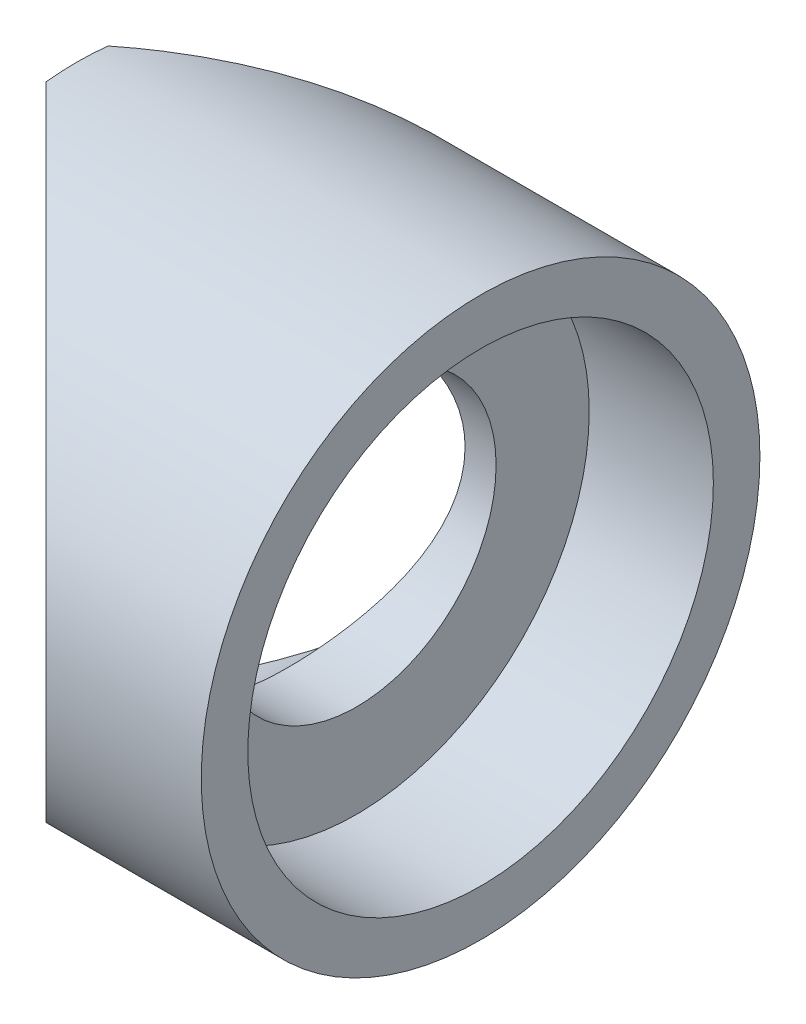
ISO-10303-21;
HEADER;
FILE_DESCRIPTION(('STEP AP214'),'2;1');
FILE_NAME('part.step','',(''),(''),'','','');
FILE_SCHEMA(('AUTOMOTIVE_DESIGN { 1 0 10303 214 1 1 1 1 }'));
ENDSEC;
DATA;
#1=APPLICATION_CONTEXT('core data for automotive mechanical design processes');
#2=APPLICATION_PROTOCOL_DEFINITION('international standard','automotive_design',2000,#1);
#3=PRODUCT_CONTEXT('',#1,'mechanical');
#4=PRODUCT('Part','Part','',(#3));
#5=PRODUCT_RELATED_PRODUCT_CATEGORY('part','',(#4));
#6=PRODUCT_DEFINITION_FORMATION('','',#4);
#7=PRODUCT_DEFINITION_CONTEXT('part definition',#1,'design');
#8=PRODUCT_DEFINITION('design','',#6,#7);
#9=PRODUCT_DEFINITION_SHAPE('','',#8);
#10=(LENGTH_UNIT() NAMED_UNIT(*) SI_UNIT(.MILLI.,.METRE.));
#11=(NAMED_UNIT(*) PLANE_ANGLE_UNIT() SI_UNIT($,.RADIAN.));
#12=(NAMED_UNIT(*) SI_UNIT($,.STERADIAN.) SOLID_ANGLE_UNIT());
#13=UNCERTAINTY_MEASURE_WITH_UNIT(LENGTH_MEASURE(1.E-05),#10,'distance_accuracy_value','');
#14=(GEOMETRIC_REPRESENTATION_CONTEXT(3) GLOBAL_UNCERTAINTY_ASSIGNED_CONTEXT((#13)) GLOBAL_UNIT_ASSIGNED_CONTEXT((#10,
#11,#12)) REPRESENTATION_CONTEXT('',''));
#15=CARTESIAN_POINT('',(0.,0.,0.));
#16=DIRECTION('',(0.,0.,1.));
#17=DIRECTION('',(1.,0.,0.));
#18=AXIS2_PLACEMENT_3D('',#15,#16,#17);
#19=CARTESIAN_POINT('',(-50.8,0.,0.));
#20=DIRECTION('',(1.,0.,0.));
#21=DIRECTION('',(0.,0.,-1.));
#22=AXIS2_PLACEMENT_3D('',#19,#20,#21);
#23=CYLINDRICAL_SURFACE('',#22,28.575);
#24=CARTESIAN_POINT('',(-41.275,0.,0.));
#25=DIRECTION('',(1.,0.,0.));
#26=DIRECTION('',(0.,1.,0.));
#27=AXIS2_PLACEMENT_3D('',#24,#25,#26);
#28=CIRCLE('',#27,28.575);
#29=CARTESIAN_POINT('',(-41.275,-28.3980633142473,-3.175));
#30=VERTEX_POINT('',#29);
#31=CARTESIAN_POINT('',(-41.275,-28.3980633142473,3.175));
#32=VERTEX_POINT('',#31);
#33=EDGE_CURVE('E54',#30,#32,#28,.F.);
#34=ORIENTED_EDGE('',*,*,#33,.F.);
#35=CARTESIAN_POINT('',(-44.45,0.,0.));
#36=DIRECTION('',(0.707106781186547,0.,0.707106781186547));
#37=DIRECTION('',(0.707106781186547,0.,-0.707106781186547));
#38=AXIS2_PLACEMENT_3D('',#35,#36,#37);
#39=ELLIPSE('',#38,40.4111525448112,28.575);
#40=CARTESIAN_POINT('',(-41.275,28.3980633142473,-3.17499999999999));
#41=VERTEX_POINT('',#40);
#42=EDGE_CURVE('E64',#41,#30,#39,.F.);
#43=ORIENTED_EDGE('',*,*,#42,.F.);
#44=CARTESIAN_POINT('',(-41.275,28.3980633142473,3.17499999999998));
#45=VERTEX_POINT('',#44);
#46=EDGE_CURVE('E48',#45,#41,#28,.F.);
#47=ORIENTED_EDGE('',*,*,#46,.F.);
#48=CARTESIAN_POINT('',(-44.45,0.,0.));
#49=DIRECTION('',(0.707106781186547,0.,-0.707106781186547));
#50=DIRECTION('',(0.707106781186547,0.,0.707106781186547));
#51=AXIS2_PLACEMENT_3D('',#48,#49,#50);
#52=ELLIPSE('',#51,40.4111525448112,28.575);
#53=EDGE_CURVE('E66',#32,#45,#52,.F.);
#54=ORIENTED_EDGE('',*,*,#53,.F.);
#55=EDGE_LOOP('',(#34,#43,#47,#54));
#56=FACE_BOUND('',#55,.T.);
#57=CARTESIAN_POINT('',(0.,0.,0.));
#58=DIRECTION('',(1.,0.,0.));
#59=DIRECTION('',(0.,0.,-1.));
#60=AXIS2_PLACEMENT_3D('',#57,#58,#59);
#61=CIRCLE('',#60,28.575);
#62=CARTESIAN_POINT('',(0.,0.,-28.575));
#63=VERTEX_POINT('',#62);
#64=EDGE_CURVE('E82',#63,#63,#61,.T.);
#65=ORIENTED_EDGE('',*,*,#64,.F.);
#66=EDGE_LOOP('',(#65));
#67=FACE_BOUND('',#66,.T.);
#68=ADVANCED_FACE('F33',(#56,#67),#23,.T.);
#69=CARTESIAN_POINT('',(-50.8,0.,0.));
#70=DIRECTION('',(1.,0.,0.));
#71=DIRECTION('',(0.,0.,-1.));
#72=AXIS2_PLACEMENT_3D('',#69,#70,#71);
#73=CYLINDRICAL_SURFACE('',#72,14.2875);
#74=CARTESIAN_POINT('',(-15.875,0.,-14.2875));
#75=CARTESIAN_POINT('',(-15.875001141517,-0.375729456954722,-14.2874987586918));
#76=CARTESIAN_POINT('',(-15.8824279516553,-0.751485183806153,-14.2726616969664));
#77=CARTESIAN_POINT('',(-15.911948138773,-1.50022926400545,-14.2134824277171));
#78=CARTESIAN_POINT('',(-15.9340478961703,-1.87321634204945,-14.1691273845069));
#79=CARTESIAN_POINT('',(-15.9923914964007,-2.61408709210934,-14.0513391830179));
#80=CARTESIAN_POINT('',(-16.02865909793,-2.98196111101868,-13.9778571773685));
#81=CARTESIAN_POINT('',(-16.1144065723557,-3.70929478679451,-13.8026705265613));
#82=CARTESIAN_POINT('',(-16.1638851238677,-4.06875528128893,-13.7009687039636));
#83=CARTESIAN_POINT('',(-16.2746170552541,-4.77555168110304,-13.4708707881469));
#84=CARTESIAN_POINT('',(-16.3358236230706,-5.12292951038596,-13.3425806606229));
#85=CARTESIAN_POINT('',(-16.468694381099,-5.80498884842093,-13.0602833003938));
#86=CARTESIAN_POINT('',(-16.5403587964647,-6.13967008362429,-12.9062755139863));
#87=CARTESIAN_POINT('',(-16.6924939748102,-6.79444061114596,-12.5739012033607));
#88=CARTESIAN_POINT('',(-16.7729614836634,-7.11453523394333,-12.3955436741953));
#89=CARTESIAN_POINT('',(-16.9409995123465,-7.7388683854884,-12.0156633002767));
#90=CARTESIAN_POINT('',(-17.0285728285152,-8.0431005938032,-11.8141313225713));
#91=CARTESIAN_POINT('',(-17.2143764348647,-8.65209785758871,-11.3764153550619));
#92=CARTESIAN_POINT('',(-17.3129309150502,-8.95578922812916,-11.138874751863));
#93=CARTESIAN_POINT('',(-17.5135867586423,-9.54234605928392,-10.6406940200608));
#94=CARTESIAN_POINT('',(-17.6156883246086,-9.82521032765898,-10.3800525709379));
#95=CARTESIAN_POINT('',(-17.8210851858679,-10.368994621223,-9.83688863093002));
#96=CARTESIAN_POINT('',(-17.9243811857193,-10.629900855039,-9.55435259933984));
#97=CARTESIAN_POINT('',(-18.129613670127,-11.1283674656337,-8.96883245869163));
#98=CARTESIAN_POINT('',(-18.2315498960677,-11.365923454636,-8.66584452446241));
#99=CARTESIAN_POINT('',(-18.4392440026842,-11.8339234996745,-8.0164402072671));
#100=CARTESIAN_POINT('',(-18.5446812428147,-12.0623728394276,-7.66847932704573));
#101=CARTESIAN_POINT('',(-18.7475603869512,-12.4888343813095,-6.9523567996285));
#102=CARTESIAN_POINT('',(-18.8450056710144,-12.686859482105,-6.58420380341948));
#103=CARTESIAN_POINT('',(-19.0285539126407,-13.0507565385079,-5.82972976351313));
#104=CARTESIAN_POINT('',(-19.1146603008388,-13.2166382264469,-5.44341426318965));
#105=CARTESIAN_POINT('',(-19.272267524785,-13.5144679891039,-4.65503044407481));
#106=CARTESIAN_POINT('',(-19.3437699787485,-13.6464198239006,-4.25296387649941));
#107=CARTESIAN_POINT('',(-19.4654160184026,-13.8678112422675,-3.46055388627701));
#108=CARTESIAN_POINT('',(-19.5165808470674,-13.9593205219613,-3.07094631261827));
#109=CARTESIAN_POINT('',(-19.6012689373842,-14.1095237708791,-2.28354760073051));
#110=CARTESIAN_POINT('',(-19.6347929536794,-14.1682191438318,-1.88575681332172));
#111=CARTESIAN_POINT('',(-19.6827283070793,-14.2518495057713,-1.08582913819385));
#112=CARTESIAN_POINT('',(-19.6971558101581,-14.2768130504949,-0.683696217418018));
#113=CARTESIAN_POINT('',(-19.7062988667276,-14.2926549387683,0.121447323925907));
#114=CARTESIAN_POINT('',(-19.7010163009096,-14.2835365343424,0.524457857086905));
#115=CARTESIAN_POINT('',(-19.6727941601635,-14.2345118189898,1.27938470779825));
#116=CARTESIAN_POINT('',(-19.6520450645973,-14.1984236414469,1.63163964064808));
#117=CARTESIAN_POINT('',(-19.5961958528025,-14.1004335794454,2.3313522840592));
#118=CARTESIAN_POINT('',(-19.5610970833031,-14.0385341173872,2.67881044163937));
#119=CARTESIAN_POINT('',(-19.4776882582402,-13.889619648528,3.36675423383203));
#120=CARTESIAN_POINT('',(-19.4293748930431,-13.8025983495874,3.7072380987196));
#121=CARTESIAN_POINT('',(-19.3210306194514,-13.6043473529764,4.37916729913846));
#122=CARTESIAN_POINT('',(-19.2609990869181,-13.4931163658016,4.71061215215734));
#123=CARTESIAN_POINT('',(-19.1294407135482,-13.244625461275,5.37025346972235));
#124=CARTESIAN_POINT('',(-19.0576810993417,-13.1068253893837,5.69819959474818));
#125=CARTESIAN_POINT('',(-18.9056514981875,-12.8080046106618,6.34141049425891));
#126=CARTESIAN_POINT('',(-18.8253784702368,-12.6469755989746,6.65667068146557));
#127=CARTESIAN_POINT('',(-18.6583651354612,-12.3027955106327,7.27313716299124));
#128=CARTESIAN_POINT('',(-18.5716238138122,-12.1196409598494,7.57434123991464));
#129=CARTESIAN_POINT('',(-18.3937139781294,-11.7322638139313,8.16151792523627));
#130=CARTESIAN_POINT('',(-18.3025451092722,-11.5280395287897,8.44748930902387));
#131=CARTESIAN_POINT('',(-18.1060294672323,-11.0722620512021,9.03847591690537));
#132=CARTESIAN_POINT('',(-18.0003535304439,-10.817992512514,9.34129150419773));
#133=CARTESIAN_POINT('',(-17.7887362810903,-10.2854128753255,9.92466048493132));
#134=CARTESIAN_POINT('',(-17.6827950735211,-10.0071111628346,10.2052215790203));
#135=CARTESIAN_POINT('',(-17.4731905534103,-9.42748219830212,10.7429813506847));
#136=CARTESIAN_POINT('',(-17.3695293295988,-9.12613487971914,11.0001592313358));
#137=CARTESIAN_POINT('',(-17.1672076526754,-8.50219839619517,11.4892269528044));
#138=CARTESIAN_POINT('',(-17.0685452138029,-8.17961778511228,11.7211268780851));
#139=CARTESIAN_POINT('',(-16.8741991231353,-7.49911967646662,12.1683720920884));
#140=CARTESIAN_POINT('',(-16.7788710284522,-7.14025491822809,12.3824345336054));
#141=CARTESIAN_POINT('',(-16.599033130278,-6.40298595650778,12.7792675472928));
#142=CARTESIAN_POINT('',(-16.5145238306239,-6.02458084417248,12.9620366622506));
#143=CARTESIAN_POINT('',(-16.3588472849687,-5.25102805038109,13.2942248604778));
#144=CARTESIAN_POINT('',(-16.2876715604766,-4.85589120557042,13.4436651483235));
#145=CARTESIAN_POINT('',(-16.1607771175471,-4.05168160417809,13.7075000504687));
#146=CARTESIAN_POINT('',(-16.1050566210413,-3.64261045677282,13.8218986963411));
#147=CARTESIAN_POINT('',(-16.0147441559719,-2.84835717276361,14.0061303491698));
#148=CARTESIAN_POINT('',(-15.9787843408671,-2.46400308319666,14.0788699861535));
#149=CARTESIAN_POINT('',(-15.9223484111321,-1.68950536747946,14.192652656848));
#150=CARTESIAN_POINT('',(-15.9018714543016,-1.29936205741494,14.2336974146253));
#151=CARTESIAN_POINT('',(-15.8769893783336,-0.516666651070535,14.2835371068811));
#152=CARTESIAN_POINT('',(-15.8725778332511,-0.124115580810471,14.2923449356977));
#153=CARTESIAN_POINT('',(-15.8799367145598,0.660218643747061,14.2776256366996));
#154=CARTESIAN_POINT('',(-15.891706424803,1.05200183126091,14.2540999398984));
#155=CARTESIAN_POINT('',(-15.929553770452,1.80121908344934,14.178111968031));
#156=CARTESIAN_POINT('',(-15.9544497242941,2.15895857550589,14.1280378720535));
#157=CARTESIAN_POINT('',(-16.0171118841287,2.8685062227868,14.0012213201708));
#158=CARTESIAN_POINT('',(-16.0548772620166,3.22031475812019,13.9244805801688));
#159=CARTESIAN_POINT('',(-16.1423975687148,3.91575267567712,13.745126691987));
#160=CARTESIAN_POINT('',(-16.192153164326,4.2593816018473,13.6425121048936));
#161=CARTESIAN_POINT('',(-16.3025278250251,4.9364047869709,13.412397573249));
#162=CARTESIAN_POINT('',(-16.3631473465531,5.26979861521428,13.284896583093));
#163=CARTESIAN_POINT('',(-16.4957954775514,5.93388388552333,13.0021387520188));
#164=CARTESIAN_POINT('',(-16.5681002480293,6.26422685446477,12.8461938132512));
#165=CARTESIAN_POINT('',(-16.7212006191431,6.91047018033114,12.5104223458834));
#166=CARTESIAN_POINT('',(-16.8019962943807,7.22637041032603,12.3305956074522));
#167=CARTESIAN_POINT('',(-16.9703615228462,7.84232453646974,11.9483058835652));
#168=CARTESIAN_POINT('',(-17.0579321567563,8.14237589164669,11.7458392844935));
#169=CARTESIAN_POINT('',(-17.2380392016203,8.72542053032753,11.3194608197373));
#170=CARTESIAN_POINT('',(-17.3305775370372,9.00840711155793,11.0955406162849));
#171=CARTESIAN_POINT('',(-17.5279127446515,9.58294924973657,10.6045363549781));
#172=CARTESIAN_POINT('',(-17.6330217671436,9.87262319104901,10.3353728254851));
#173=CARTESIAN_POINT('',(-17.8442645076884,10.4285136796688,9.77418874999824));
#174=CARTESIAN_POINT('',(-17.9503982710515,10.6947291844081,9.48216718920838));
#175=CARTESIAN_POINT('',(-18.1610259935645,11.2025028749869,8.87653247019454));
#176=CARTESIAN_POINT('',(-18.2655189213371,11.444046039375,8.56290635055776));
#177=CARTESIAN_POINT('',(-18.4699890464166,11.9009378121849,7.91563587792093));
#178=CARTESIAN_POINT('',(-18.5699654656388,12.1162819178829,7.58198809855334));
#179=CARTESIAN_POINT('',(-18.7671848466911,12.5291061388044,6.87954179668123));
#180=CARTESIAN_POINT('',(-18.8640563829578,12.7252018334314,6.50982249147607));
#181=CARTESIAN_POINT('',(-19.0461967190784,13.0850327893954,5.75241277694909));
#182=CARTESIAN_POINT('',(-19.1314711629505,13.2487838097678,5.36473123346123));
#183=CARTESIAN_POINT('',(-19.2871293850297,13.5420879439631,4.57407230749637));
#184=CARTESIAN_POINT('',(-19.3575250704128,13.6716684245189,4.17110746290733));
#185=CARTESIAN_POINT('',(-19.4805134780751,13.8950237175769,3.3527286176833));
#186=CARTESIAN_POINT('',(-19.5331089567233,13.9888040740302,2.93731655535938));
#187=CARTESIAN_POINT('',(-19.6140014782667,14.1318743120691,2.13808897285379));
#188=CARTESIAN_POINT('',(-19.6441463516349,14.1845708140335,1.75506828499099));
#189=CARTESIAN_POINT('',(-19.6867095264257,14.2587491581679,0.985036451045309));
#190=CARTESIAN_POINT('',(-19.6991290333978,14.2802331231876,0.598025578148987));
#191=CARTESIAN_POINT('',(-19.7057238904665,14.291657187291,-0.176470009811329));
#192=CARTESIAN_POINT('',(-19.6999059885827,14.2816089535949,-0.563954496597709));
#193=CARTESIAN_POINT('',(-19.6702829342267,14.2301485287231,-1.33612715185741));
#194=CARTESIAN_POINT('',(-19.6464785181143,14.1887376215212,-1.72081543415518));
#195=CARTESIAN_POINT('',(-19.5849563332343,14.0806130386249,-2.44761227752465));
#196=CARTESIAN_POINT('',(-19.5487869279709,14.016698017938,-2.79027449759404));
#197=CARTESIAN_POINT('',(-19.4636834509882,13.8644226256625,-3.46861810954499));
#198=CARTESIAN_POINT('',(-19.4147451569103,13.7760541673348,-3.80429715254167));
#199=CARTESIAN_POINT('',(-19.3055732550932,13.5757658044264,-4.46665014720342));
#200=CARTESIAN_POINT('',(-19.2453395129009,13.4638456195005,-4.79332399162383));
#201=CARTESIAN_POINT('',(-19.1152455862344,13.2174219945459,-5.43607401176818));
#202=CARTESIAN_POINT('',(-19.0453844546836,13.082916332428,-5.75214914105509));
#203=CARTESIAN_POINT('',(-18.8928719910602,12.7825686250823,-6.3931314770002));
#204=CARTESIAN_POINT('',(-18.809676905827,12.6152292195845,-6.71720748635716));
#205=CARTESIAN_POINT('',(-18.6365934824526,12.2571693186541,-7.35028752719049));
#206=CARTESIAN_POINT('',(-18.546704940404,12.0664481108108,-7.65929109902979));
#207=CARTESIAN_POINT('',(-18.3624219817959,11.6626820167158,-8.26110488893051));
#208=CARTESIAN_POINT('',(-18.2680258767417,11.4496287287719,-8.55390894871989));
#209=CARTESIAN_POINT('',(-18.0769274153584,11.0023102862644,-9.12209341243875));
#210=CARTESIAN_POINT('',(-17.9802247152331,10.7680419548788,-9.39747119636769));
#211=CARTESIAN_POINT('',(-17.774845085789,10.2495676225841,-9.96209091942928));
#212=CARTESIAN_POINT('',(-17.6661442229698,9.96275459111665,-10.2489365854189));
#213=CARTESIAN_POINT('',(-17.4514473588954,9.36533493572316,-10.7975733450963));
#214=CARTESIAN_POINT('',(-17.3454505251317,9.05473575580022,-11.0593722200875));
#215=CARTESIAN_POINT('',(-17.1388156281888,8.41095661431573,-11.5565561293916));
#216=CARTESIAN_POINT('',(-17.038181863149,8.07775901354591,-11.7919201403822));
#217=CARTESIAN_POINT('',(-16.8450300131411,7.39077435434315,-12.2342135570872));
#218=CARTESIAN_POINT('',(-16.752511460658,7.03698848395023,-12.4411446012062));
#219=CARTESIAN_POINT('',(-16.577468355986,6.30824900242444,-12.8261320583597));
#220=CARTESIAN_POINT('',(-16.495020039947,5.93316205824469,-13.0039713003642));
#221=CARTESIAN_POINT('',(-16.3432424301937,5.16657150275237,-13.3271232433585));
#222=CARTESIAN_POINT('',(-16.2739150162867,4.77506554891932,-13.4724312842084));
#223=CARTESIAN_POINT('',(-16.1506233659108,3.97963239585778,-13.7284122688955));
#224=CARTESIAN_POINT('',(-16.0966208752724,3.57573896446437,-13.8391715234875));
#225=CARTESIAN_POINT('',(-16.0054550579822,2.75816361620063,-14.0250044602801));
#226=CARTESIAN_POINT('',(-15.9682814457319,2.34448784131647,-14.1000999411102));
#227=CARTESIAN_POINT('',(-15.9185373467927,1.60889183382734,-14.200273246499));
#228=CARTESIAN_POINT('',(-15.9022393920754,1.28823483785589,-14.2329552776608));
#229=CARTESIAN_POINT('',(-15.8804700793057,0.645058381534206,-14.2765694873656));
#230=CARTESIAN_POINT('',(-15.8749990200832,0.322538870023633,-14.2875010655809));
#231=CARTESIAN_POINT('',(-15.875,0.,-14.2875));
#232=B_SPLINE_CURVE_WITH_KNOTS('',3,(#74,#75,#76,#77,#78,#79,#80,#81,#82,#83,#84,#85,#86,#87,
#88,#89,#90,#91,#92,#93,#94,#95,#96,#97,#98,#99,#100,#101,#102,#103,#104,#105,#106,#107,#108,
#109,#110,#111,#112,#113,#114,#115,#116,#117,#118,#119,#120,#121,#122,#123,#124,#125,#126,#127,
#128,#129,#130,#131,#132,#133,#134,#135,#136,#137,#138,#139,#140,#141,#142,#143,#144,#145,#146,
#147,#148,#149,#150,#151,#152,#153,#154,#155,#156,#157,#158,#159,#160,#161,#162,#163,#164,#165,
#166,#167,#168,#169,#170,#171,#172,#173,#174,#175,#176,#177,#178,#179,#180,#181,#182,#183,#184,
#185,#186,#187,#188,#189,#190,#191,#192,#193,#194,#195,#196,#197,#198,#199,#200,#201,#202,#203,
#204,#205,#206,#207,#208,#209,#210,#211,#212,#213,#214,#215,#216,#217,#218,#219,#220,#221,#222,
#223,#224,#225,#226,#227,#228,#229,#230,#231),.UNSPECIFIED.,.T.,.F.,(4,2,2,2,2,2,2,2,2,2,2,2,2,
2,2,2,2,2,2,2,2,2,2,2,2,2,2,2,2,2,2,2,2,2,2,2,2,2,2,2,2,2,2,2,2,2,2,2,2,2,2,2,2,2,2,2,2,2,2,2,2,
2,2,2,2,2,2,2,2,2,2,2,2,2,2,2,2,2,4),(0.,1.12687025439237,2.25423084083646,3.38349012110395,
4.51263649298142,5.63736641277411,6.76212055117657,7.88646031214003,9.01124469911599,
10.2038411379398,11.3965057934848,12.5899140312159,13.7835460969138,15.0701380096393,
16.3561829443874,17.6418378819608,18.9273502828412,20.1360213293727,21.3446406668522,
22.552236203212,23.7597165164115,24.8225819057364,25.8853475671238,26.9483796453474,
28.011468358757,29.0990249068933,30.1869712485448,31.2750886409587,32.3632933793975,
33.5898172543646,34.8159148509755,36.0430924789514,37.2697787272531,38.5538794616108,
39.8380399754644,41.1213811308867,42.4045745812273,43.5814748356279,44.7583110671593,
45.9346765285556,47.1109899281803,48.1959840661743,49.2809084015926,50.3658930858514,
51.4509233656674,52.5669097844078,53.6829060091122,54.7990806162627,55.91569078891,
57.1418137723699,58.3679912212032,59.5949108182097,60.8220409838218,62.1090496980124,
63.3954297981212,64.68077650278,65.9659240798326,67.1277064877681,68.2894098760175,
69.4506834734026,70.6119095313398,71.6620789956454,72.7125961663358,73.7631258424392,
74.8137589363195,75.9349123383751,77.0560999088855,78.1777108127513,79.2994899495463,
80.5578940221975,81.8159058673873,83.0749112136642,84.3338439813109,85.6017835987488,
86.8699047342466,88.1348319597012,89.3989850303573,90.3663018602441,91.3336453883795),.UNSPECIFIED.);
#233=CARTESIAN_POINT('',(-15.875,0.,-14.2875));
#234=VERTEX_POINT('',#233);
#235=EDGE_CURVE('E75',#234,#234,#232,.T.);
#236=ORIENTED_EDGE('',*,*,#235,.T.);
#237=EDGE_LOOP('',(#236));
#238=FACE_BOUND('',#237,.T.);
#239=CARTESIAN_POINT('',(-12.7,0.,0.));
#240=DIRECTION('',(1.,0.,0.));
#241=DIRECTION('',(0.,0.,-1.));
#242=AXIS2_PLACEMENT_3D('',#239,#240,#241);
#243=CIRCLE('',#242,14.2875);
#244=CARTESIAN_POINT('',(-12.7,0.,-14.2875));
#245=VERTEX_POINT('',#244);
#246=EDGE_CURVE('E162',#245,#245,#243,.F.);
#247=ORIENTED_EDGE('',*,*,#246,.F.);
#248=EDGE_LOOP('',(#247));
#249=FACE_BOUND('',#248,.T.);
#250=ADVANCED_FACE('F85',(#238,#249),#73,.F.);
#251=CARTESIAN_POINT('',(0.,0.,0.));
#252=DIRECTION('',(1.,0.,0.));
#253=DIRECTION('',(0.,0.,-1.));
#254=AXIS2_PLACEMENT_3D('',#251,#252,#253);
#255=PLANE('',#254);
#256=CARTESIAN_POINT('',(0.,0.,0.));
#257=DIRECTION('',(1.,0.,0.));
#258=DIRECTION('',(0.,0.,-1.));
#259=AXIS2_PLACEMENT_3D('',#256,#257,#258);
#260=CIRCLE('',#259,23.8125);
#261=CARTESIAN_POINT('',(0.,0.,-23.8125));
#262=VERTEX_POINT('',#261);
#263=EDGE_CURVE('E72',#262,#262,#260,.T.);
#264=ORIENTED_EDGE('',*,*,#263,.F.);
#265=EDGE_LOOP('',(#264));
#266=FACE_BOUND('',#265,.T.);
#267=ORIENTED_EDGE('',*,*,#64,.T.);
#268=EDGE_LOOP('',(#267));
#269=FACE_BOUND('',#268,.T.);
#270=ADVANCED_FACE('F90',(#266,#269),#255,.T.);
#271=CARTESIAN_POINT('',(-12.7,0.,0.));
#272=DIRECTION('',(1.,0.,0.));
#273=DIRECTION('',(0.,0.,-1.));
#274=AXIS2_PLACEMENT_3D('',#271,#272,#273);
#275=PLANE('',#274);
#276=CARTESIAN_POINT('',(-12.7,0.,0.));
#277=DIRECTION('',(1.,0.,0.));
#278=DIRECTION('',(0.,0.,-1.));
#279=AXIS2_PLACEMENT_3D('',#276,#277,#278);
#280=CIRCLE('',#279,23.8125);
#281=CARTESIAN_POINT('',(-12.7,0.,-23.8125));
#282=VERTEX_POINT('',#281);
#283=EDGE_CURVE('E83',#282,#282,#280,.T.);
#284=ORIENTED_EDGE('',*,*,#283,.T.);
#285=EDGE_LOOP('',(#284));
#286=FACE_BOUND('',#285,.T.);
#287=ORIENTED_EDGE('',*,*,#246,.T.);
#288=EDGE_LOOP('',(#287));
#289=FACE_BOUND('',#288,.T.);
#290=ADVANCED_FACE('F96',(#286,#289),#275,.T.);
#291=CARTESIAN_POINT('',(-12.7,0.,0.));
#292=DIRECTION('',(1.,0.,0.));
#293=DIRECTION('',(0.,0.,-1.));
#294=AXIS2_PLACEMENT_3D('',#291,#292,#293);
#295=CYLINDRICAL_SURFACE('',#294,23.8125);
#296=ORIENTED_EDGE('',*,*,#283,.F.);
#297=EDGE_LOOP('',(#296));
#298=FACE_BOUND('',#297,.T.);
#299=ORIENTED_EDGE('',*,*,#263,.T.);
#300=EDGE_LOOP('',(#299));
#301=FACE_BOUND('',#300,.T.);
#302=ADVANCED_FACE('F93',(#298,#301),#295,.F.);
#303=CARTESIAN_POINT('',(-44.45,0.,-31.75));
#304=DIRECTION('',(0.,0.,1.));
#305=DIRECTION('',(1.,0.,0.));
#306=AXIS2_PLACEMENT_3D('',#303,#304,#305);
#307=CYLINDRICAL_SURFACE('',#306,28.575);
#308=ORIENTED_EDGE('',*,*,#53,.T.);
#309=DIRECTION('',(0.,0.,1.));
#310=VECTOR('',#309,1.);
#311=CARTESIAN_POINT('',(-41.275,28.3980633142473,-31.75));
#312=LINE('',#311,#310);
#313=EDGE_CURVE('E11',#45,#41,#312,.F.);
#314=ORIENTED_EDGE('',*,*,#313,.T.);
#315=ORIENTED_EDGE('',*,*,#42,.T.);
#316=DIRECTION('',(0.,0.,1.));
#317=VECTOR('',#316,1.);
#318=CARTESIAN_POINT('',(-41.275,-28.3980633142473,-31.75));
#319=LINE('',#318,#317);
#320=EDGE_CURVE('E42',#30,#32,#319,.T.);
#321=ORIENTED_EDGE('',*,*,#320,.T.);
#322=EDGE_LOOP('',(#308,#314,#315,#321));
#323=FACE_BOUND('',#322,.T.);
#324=ORIENTED_EDGE('',*,*,#235,.F.);
#325=EDGE_LOOP('',(#324));
#326=FACE_BOUND('',#325,.T.);
#327=ADVANCED_FACE('F35',(#323,#326),#307,.F.);
#328=CARTESIAN_POINT('',(-41.275,28.575,-31.75));
#329=DIRECTION('',(1.,0.,0.));
#330=DIRECTION('',(0.,1.,0.));
#331=AXIS2_PLACEMENT_3D('',#328,#329,#330);
#332=PLANE('',#331);
#333=ORIENTED_EDGE('',*,*,#320,.F.);
#334=ORIENTED_EDGE('',*,*,#33,.T.);
#335=EDGE_LOOP('',(#333,#334));
#336=FACE_BOUND('',#335,.T.);
#337=ADVANCED_FACE('F68',(#336),#332,.F.);
#338=ORIENTED_EDGE('',*,*,#46,.T.);
#339=ORIENTED_EDGE('',*,*,#313,.F.);
#340=EDGE_LOOP('',(#338,#339));
#341=FACE_BOUND('',#340,.T.);
#342=ADVANCED_FACE('F132',(#341),#332,.F.);
#343=CLOSED_SHELL('',(#68,#250,#270,#290,#302,#327,#337,#342));
#344=MANIFOLD_SOLID_BREP('B2',#343);
#345=ADVANCED_BREP_SHAPE_REPRESENTATION('',(#18,#344),#14);
#346=SHAPE_DEFINITION_REPRESENTATION(#9,#345);
ENDSEC;
END-ISO-10303-21;
